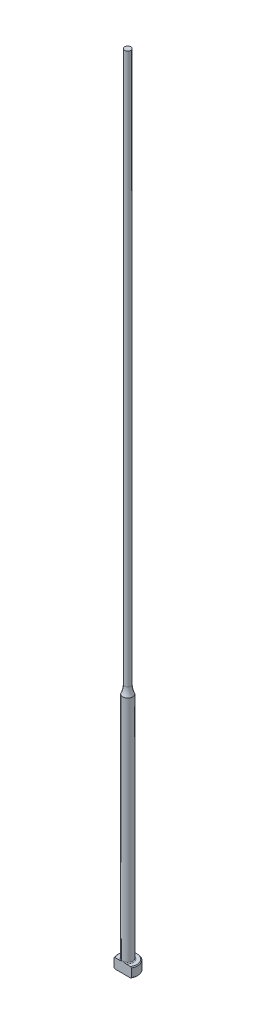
from build123d import *

# Parameters (mm, degrees)
CHAMFER1_SIZE      = 0.254
FILLET1_R          = 0.254
CUT_EXTRUDE1_DEPTH = 255.0396844


with BuildPart() as part:
    # Sketch1 → Revolve1 (revolve)
    with BuildSketch(Plane.XY, mode=Mode.PRIVATE) as revolve1_sk:
        with BuildLine():
            Line((0, 0), (-3.175, 0))
            Line((-3.175, 0), (-3.175, 3.175))
            Line((-3.175, 3.175), (-1.5875, 3.175))
            Line((-1.5875, 3.175), (-1.5875, 76.2))
            ThreePointArc((-1.5875, 76.2), (-1.142565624, 77.509911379), (-0.99187, 78.885093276))
            Line((-0.99187, 78.885093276), (-0.99187, 254))
            Line((-0.99187, 254), (0, 254))
            Line((0, 254), (0, 0))
        make_face()
    revolve(revolve1_sk.sketch.rotate(Axis((0, 259.958771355, 0), (0, -1, 0)), 270), axis=Axis((0, 259.958771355, 0), (0, -1, 0)))

    # Chamfer1
    chamfer1_edges = [part.edges().sort_by_distance(p)[0] for p in [
        (0, 0, -3.175),
        (0, 3.175, -3.175),
    ]]
    chamfer(chamfer1_edges, length=CHAMFER1_SIZE)

    # Fillet1
    fillet1_edges = [part.edges().sort_by_distance(p)[0] for p in [
        (0, 3.175, -1.5875),
    ]]
    fillet(fillet1_edges, radius=FILLET1_R)

    # Sketch2 → Cut-Extrude1 (cut, through all)
    with BuildSketch(Plane.XZ):
        with BuildLine():
            Line((-2.749630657, 1.5875), (2.749630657, 1.5875))
            ThreePointArc((2.749630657, 1.5875), (0, 3.175), (-2.749630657, 1.5875))
        make_face()
    extrude(amount=-CUT_EXTRUDE1_DEPTH, mode=Mode.SUBTRACT)


solid = part.part
